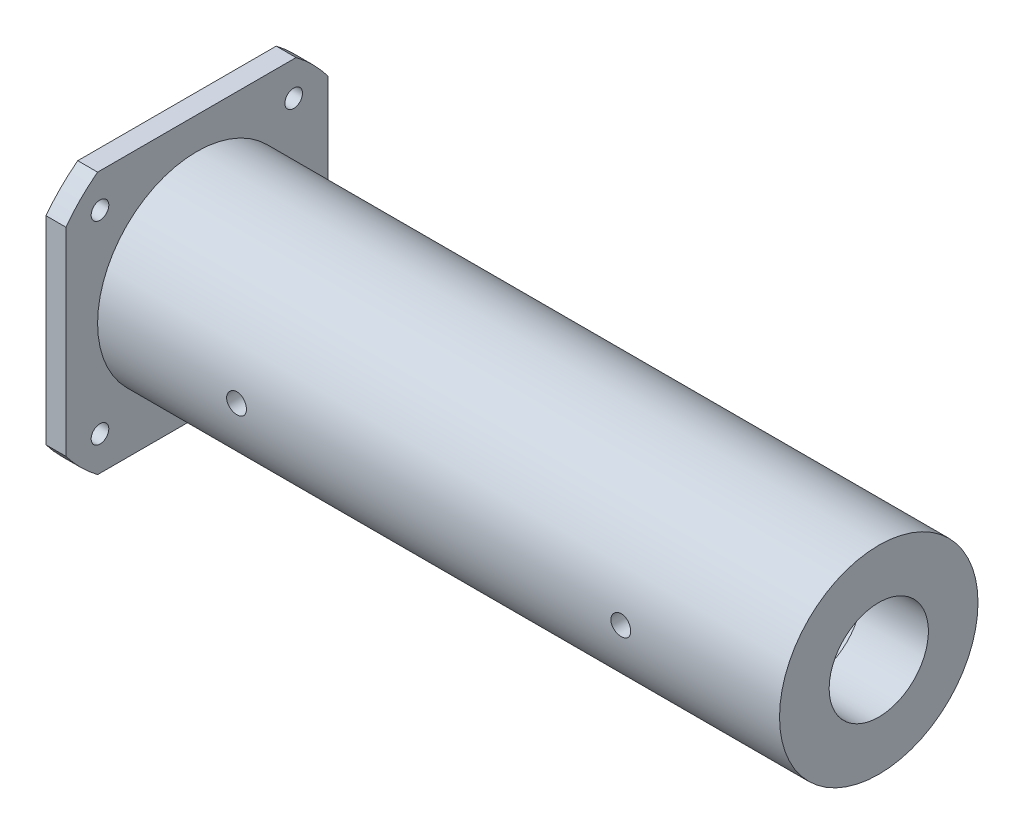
from build123d import *

# Parameters (mm, degrees)
SKETCH2_R               = 31.158376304
CUT_EXTRUDE2_DEPTH      = 119.263802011
SKETCH3_R               = 1.4097
CUT_EXTRUDE4_DEPTH      = 117.11342676
BOSS_EXTRUDE1_DEPTH     = 88.9
CUT_EXTRUDE5_DEPTH      = 117.11342676
CUT_EXTRUDE5_DEPTH_BACK = 117.11342676
SKETCH5_R               = 1.5875


with BuildPart() as part:
    # Sketch1 → Base-Revolve (revolve)
    with BuildSketch(Plane.XY, mode=Mode.PRIVATE) as base_revolve_sk:
        Polygon((0, 14.2748), (0, 26.289), (3.175, 26.289), (3.175, 15.875), (112.268, 15.875), (112.268, 7.9375), (101.6, 7.9375), (101.6, 14.2748), align=None)
    revolve(base_revolve_sk.sketch.rotate(Axis((0, 0, 0), (1, 0, 0)), 90), axis=Axis((0, 0, 0), (1, 0, 0)))

    # Sketch2 → Cut-Extrude2 (cut, through all)
    with BuildSketch(Plane(origin=(0, 0, 0), x_dir=(0, 0, -1), z_dir=(1, 0, 0))):
        Circle(SKETCH2_R)
        with BuildLine():
            Line((-15.874491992, 20.955), (15.874491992, 20.955))
            ThreePointArc((15.874491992, 20.955), (18.589130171, 18.589130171), (20.955, 15.874491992))
            Line((20.955, 15.874491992), (20.955, -15.874491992))
            ThreePointArc((20.955, -15.874491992), (18.589130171, -18.589130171), (15.874491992, -20.955))
            Line((15.874491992, -20.955), (-15.874491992, -20.955))
            ThreePointArc((-15.874491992, -20.955), (-18.589130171, -18.589130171), (-20.955, -15.874491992))
            Line((-20.955, -15.874491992), (-20.955, 15.874491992))
            ThreePointArc((-20.955, 15.874491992), (-18.589130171, 18.589130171), (-15.874491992, 20.955))
        make_face(mode=Mode.SUBTRACT)
    extrude(amount=CUT_EXTRUDE2_DEPTH, mode=Mode.SUBTRACT)

    # Sketch3 → Cut-Extrude4 (cut, through all)
    with BuildSketch(Plane(origin=(0, 0, 0), x_dir=(0, 0, -1), z_dir=(1, 0, 0))):
        with Locations(Location((-15.494, 15.501470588, 0), (0, 0, 180))):
            Circle(SKETCH3_R)
        with Locations(Location((15.494, 15.501470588, 0), (0, 0, 180))):
            Circle(SKETCH3_R)
        with Locations(Location((15.494, -15.494, 0), (0, 0, 180))):
            Circle(SKETCH3_R)
        with Locations(Location((-15.494, -15.494, 0), (0, 0, 180))):
            Circle(SKETCH3_R)
    extrude(amount=CUT_EXTRUDE4_DEPTH, mode=Mode.SUBTRACT)

    # Sketch4 → Boss-Extrude1 (add)
    with BuildSketch(Plane(origin=(9.525, 0, 0), x_dir=(0, 0, -1), z_dir=(1, 0, 0))):
        with BuildLine():
            Line((-12.784655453, 6.35), (-11.176, 6.35))
            Line((-11.176, 6.35), (-11.176, -6.35))
            Line((-11.176, -6.35), (-12.784655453, -6.35))
            ThreePointArc((-12.784655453, -6.35), (-14.2748, 0), (-12.784655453, 6.35))
        make_face()
    extrude(amount=BOSS_EXTRUDE1_DEPTH)

    # Sketch5 → Cut-Extrude5 (cut, two sides: drawn at the far end of the back side and taken through both)
    with BuildSketch(Plane.XY.offset(-CUT_EXTRUDE5_DEPTH_BACK)):
        with Locations((25.4, 0)):
            Circle(SKETCH5_R)
        with Locations((86.868, 0)):
            Circle(SKETCH5_R)
    extrude(amount=CUT_EXTRUDE5_DEPTH + CUT_EXTRUDE5_DEPTH_BACK, mode=Mode.SUBTRACT)


solid = part.part
